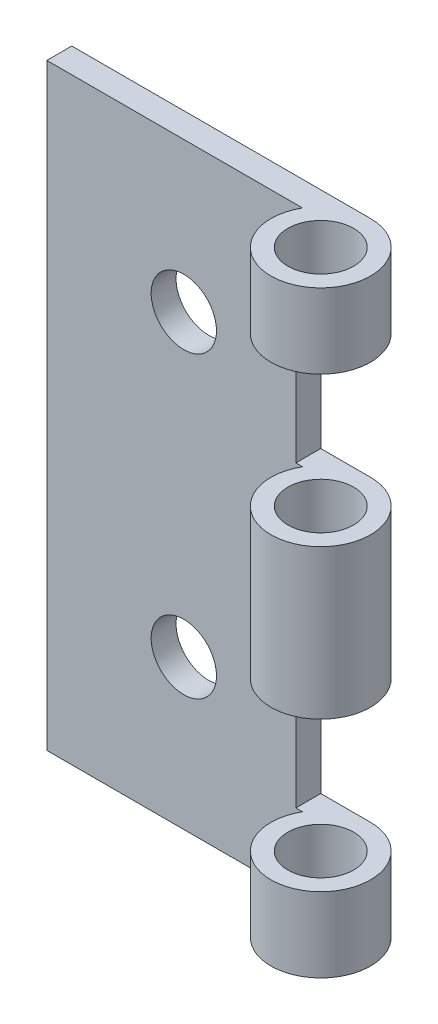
ISO-10303-21;
HEADER;
FILE_DESCRIPTION(('STEP AP214'),'2;1');
FILE_NAME('part.step','',(''),(''),'','','');
FILE_SCHEMA(('AUTOMOTIVE_DESIGN { 1 0 10303 214 1 1 1 1 }'));
ENDSEC;
DATA;
#1=APPLICATION_CONTEXT('core data for automotive mechanical design processes');
#2=APPLICATION_PROTOCOL_DEFINITION('international standard','automotive_design',2000,#1);
#3=PRODUCT_CONTEXT('',#1,'mechanical');
#4=PRODUCT('Part','Part','',(#3));
#5=PRODUCT_RELATED_PRODUCT_CATEGORY('part','',(#4));
#6=PRODUCT_DEFINITION_FORMATION('','',#4);
#7=PRODUCT_DEFINITION_CONTEXT('part definition',#1,'design');
#8=PRODUCT_DEFINITION('design','',#6,#7);
#9=PRODUCT_DEFINITION_SHAPE('','',#8);
#10=(LENGTH_UNIT() NAMED_UNIT(*) SI_UNIT(.MILLI.,.METRE.));
#11=(NAMED_UNIT(*) PLANE_ANGLE_UNIT() SI_UNIT($,.RADIAN.));
#12=(NAMED_UNIT(*) SI_UNIT($,.STERADIAN.) SOLID_ANGLE_UNIT());
#13=UNCERTAINTY_MEASURE_WITH_UNIT(LENGTH_MEASURE(1.E-05),#10,'distance_accuracy_value','');
#14=(GEOMETRIC_REPRESENTATION_CONTEXT(3) GLOBAL_UNCERTAINTY_ASSIGNED_CONTEXT((#13)) GLOBAL_UNIT_ASSIGNED_CONTEXT((#10,
#11,#12)) REPRESENTATION_CONTEXT('',''));
#15=CARTESIAN_POINT('',(0.,0.,0.));
#16=DIRECTION('',(0.,0.,1.));
#17=DIRECTION('',(1.,0.,0.));
#18=AXIS2_PLACEMENT_3D('',#15,#16,#17);
#19=CARTESIAN_POINT('',(0.,76.2,-3.175));
#20=DIRECTION('',(0.,0.,1.));
#21=DIRECTION('',(1.,0.,0.));
#22=AXIS2_PLACEMENT_3D('',#19,#20,#21);
#23=PLANE('',#22);
#24=CARTESIAN_POINT('',(-20.6375,19.05,-3.175));
#25=DIRECTION('',(0.,0.,1.));
#26=DIRECTION('',(1.,0.,0.));
#27=AXIS2_PLACEMENT_3D('',#24,#25,#26);
#28=CIRCLE('',#27,4.1656);
#29=CARTESIAN_POINT('',(-16.4719,19.05,-3.175));
#30=VERTEX_POINT('',#29);
#31=EDGE_CURVE('E196',#30,#30,#28,.T.);
#32=ORIENTED_EDGE('',*,*,#31,.T.);
#33=EDGE_LOOP('',(#32));
#34=FACE_BOUND('',#33,.T.);
#35=CARTESIAN_POINT('',(-20.6375,57.15,-3.175));
#36=DIRECTION('',(0.,0.,1.));
#37=DIRECTION('',(1.,0.,0.));
#38=AXIS2_PLACEMENT_3D('',#35,#36,#37);
#39=CIRCLE('',#38,4.1656);
#40=CARTESIAN_POINT('',(-16.4719,57.15,-3.175));
#41=VERTEX_POINT('',#40);
#42=EDGE_CURVE('E202',#41,#41,#39,.T.);
#43=ORIENTED_EDGE('',*,*,#42,.T.);
#44=EDGE_LOOP('',(#43));
#45=FACE_BOUND('',#44,.T.);
#46=DIRECTION('',(1.,0.,0.));
#47=VECTOR('',#46,1.);
#48=CARTESIAN_POINT('',(0.,28.575,-3.175));
#49=LINE('',#48,#47);
#50=CARTESIAN_POINT('',(-6.35000000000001,28.575,-3.175));
#51=VERTEX_POINT('',#50);
#52=CARTESIAN_POINT('',(0.,28.575,-3.175));
#53=VERTEX_POINT('',#52);
#54=EDGE_CURVE('E133',#51,#53,#49,.T.);
#55=ORIENTED_EDGE('',*,*,#54,.F.);
#56=DIRECTION('',(0.,1.,0.));
#57=VECTOR('',#56,1.);
#58=CARTESIAN_POINT('',(-6.35000000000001,76.2,-3.175));
#59=LINE('',#58,#57);
#60=CARTESIAN_POINT('',(-6.35000000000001,9.525,-3.175));
#61=VERTEX_POINT('',#60);
#62=EDGE_CURVE('E132',#61,#51,#59,.T.);
#63=ORIENTED_EDGE('',*,*,#62,.F.);
#64=DIRECTION('',(-1.,0.,0.));
#65=VECTOR('',#64,1.);
#66=CARTESIAN_POINT('',(0.,9.52499999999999,-3.175));
#67=LINE('',#66,#65);
#68=CARTESIAN_POINT('',(0.,9.52499999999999,-3.175));
#69=VERTEX_POINT('',#68);
#70=EDGE_CURVE('E139',#69,#61,#67,.T.);
#71=ORIENTED_EDGE('',*,*,#70,.F.);
#72=DIRECTION('',(0.,1.,0.));
#73=VECTOR('',#72,1.);
#74=CARTESIAN_POINT('',(0.,0.,-3.175));
#75=LINE('',#74,#73);
#76=CARTESIAN_POINT('',(0.,0.,-3.175));
#77=VERTEX_POINT('',#76);
#78=EDGE_CURVE('E213',#77,#69,#75,.T.);
#79=ORIENTED_EDGE('',*,*,#78,.F.);
#80=DIRECTION('',(1.,0.,0.));
#81=VECTOR('',#80,1.);
#82=CARTESIAN_POINT('',(0.,0.,-3.175));
#83=LINE('',#82,#81);
#84=CARTESIAN_POINT('',(-38.1,0.,-3.175));
#85=VERTEX_POINT('',#84);
#86=EDGE_CURVE('E223',#85,#77,#83,.T.);
#87=ORIENTED_EDGE('',*,*,#86,.F.);
#88=DIRECTION('',(0.,-1.,0.));
#89=VECTOR('',#88,1.);
#90=CARTESIAN_POINT('',(-38.1,0.,-3.175));
#91=LINE('',#90,#89);
#92=CARTESIAN_POINT('',(-38.1,76.2,-3.175));
#93=VERTEX_POINT('',#92);
#94=EDGE_CURVE('E220',#93,#85,#91,.T.);
#95=ORIENTED_EDGE('',*,*,#94,.F.);
#96=DIRECTION('',(-1.,0.,0.));
#97=VECTOR('',#96,1.);
#98=CARTESIAN_POINT('',(0.,76.2,-3.175));
#99=LINE('',#98,#97);
#100=CARTESIAN_POINT('',(0.,76.2,-3.175));
#101=VERTEX_POINT('',#100);
#102=EDGE_CURVE('E216',#101,#93,#99,.T.);
#103=ORIENTED_EDGE('',*,*,#102,.F.);
#104=CARTESIAN_POINT('',(0.,66.675,-3.175));
#105=VERTEX_POINT('',#104);
#106=EDGE_CURVE('E212',#105,#101,#75,.T.);
#107=ORIENTED_EDGE('',*,*,#106,.F.);
#108=DIRECTION('',(1.,0.,0.));
#109=VECTOR('',#108,1.);
#110=CARTESIAN_POINT('',(0.,66.675,-3.175));
#111=LINE('',#110,#109);
#112=CARTESIAN_POINT('',(-6.35000000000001,66.675,-3.175));
#113=VERTEX_POINT('',#112);
#114=EDGE_CURVE('E173',#113,#105,#111,.T.);
#115=ORIENTED_EDGE('',*,*,#114,.F.);
#116=DIRECTION('',(0.,1.,0.));
#117=VECTOR('',#116,1.);
#118=CARTESIAN_POINT('',(-6.35000000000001,76.2,-3.175));
#119=LINE('',#118,#117);
#120=CARTESIAN_POINT('',(-6.35000000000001,47.625,-3.175));
#121=VERTEX_POINT('',#120);
#122=EDGE_CURVE('E179',#121,#113,#119,.T.);
#123=ORIENTED_EDGE('',*,*,#122,.F.);
#124=DIRECTION('',(-1.,0.,0.));
#125=VECTOR('',#124,1.);
#126=CARTESIAN_POINT('',(0.,47.625,-3.175));
#127=LINE('',#126,#125);
#128=CARTESIAN_POINT('',(0.,47.625,-3.175));
#129=VERTEX_POINT('',#128);
#130=EDGE_CURVE('E167',#129,#121,#127,.T.);
#131=ORIENTED_EDGE('',*,*,#130,.F.);
#132=EDGE_CURVE('E217',#53,#129,#75,.T.);
#133=ORIENTED_EDGE('',*,*,#132,.F.);
#134=EDGE_LOOP('',(#55,#63,#71,#79,#87,#95,#103,#107,#115,#123,#131,#133));
#135=FACE_BOUND('',#134,.T.);
#136=ADVANCED_FACE('F30',(#34,#45,#135),#23,.F.);
#137=CARTESIAN_POINT('',(0.,76.2,0.));
#138=DIRECTION('',(0.,0.,1.));
#139=DIRECTION('',(1.,0.,0.));
#140=AXIS2_PLACEMENT_3D('',#137,#138,#139);
#141=PLANE('',#140);
#142=CARTESIAN_POINT('',(-20.6375,19.05,0.));
#143=DIRECTION('',(0.,0.,1.));
#144=DIRECTION('',(1.,0.,0.));
#145=AXIS2_PLACEMENT_3D('',#142,#143,#144);
#146=CIRCLE('',#145,4.1656);
#147=CARTESIAN_POINT('',(-16.4719,19.05,0.));
#148=VERTEX_POINT('',#147);
#149=EDGE_CURVE('E193',#148,#148,#146,.T.);
#150=ORIENTED_EDGE('',*,*,#149,.F.);
#151=EDGE_LOOP('',(#150));
#152=FACE_BOUND('',#151,.T.);
#153=CARTESIAN_POINT('',(-20.6375,57.15,0.));
#154=DIRECTION('',(0.,0.,1.));
#155=DIRECTION('',(1.,0.,0.));
#156=AXIS2_PLACEMENT_3D('',#153,#154,#155);
#157=CIRCLE('',#156,4.1656);
#158=CARTESIAN_POINT('',(-16.4719,57.15,0.));
#159=VERTEX_POINT('',#158);
#160=EDGE_CURVE('E199',#159,#159,#157,.T.);
#161=ORIENTED_EDGE('',*,*,#160,.F.);
#162=EDGE_LOOP('',(#161));
#163=FACE_BOUND('',#162,.T.);
#164=DIRECTION('',(0.,1.,0.));
#165=VECTOR('',#164,1.);
#166=CARTESIAN_POINT('',(-6.35000000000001,76.2,0.));
#167=LINE('',#166,#165);
#168=CARTESIAN_POINT('',(-6.35000000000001,9.525,0.));
#169=VERTEX_POINT('',#168);
#170=CARTESIAN_POINT('',(-6.35000000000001,28.575,0.));
#171=VERTEX_POINT('',#170);
#172=EDGE_CURVE('E123',#169,#171,#167,.T.);
#173=ORIENTED_EDGE('',*,*,#172,.T.);
#174=DIRECTION('',(1.,0.,0.));
#175=VECTOR('',#174,1.);
#176=CARTESIAN_POINT('',(0.,28.575,0.));
#177=LINE('',#176,#175);
#178=CARTESIAN_POINT('',(-5.49926131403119,28.575,0.));
#179=VERTEX_POINT('',#178);
#180=EDGE_CURVE('E150',#171,#179,#177,.T.);
#181=ORIENTED_EDGE('',*,*,#180,.T.);
#182=DIRECTION('',(0.,-1.,0.));
#183=VECTOR('',#182,1.);
#184=CARTESIAN_POINT('',(-5.49926131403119,76.2,0.));
#185=LINE('',#184,#183);
#186=CARTESIAN_POINT('',(-5.49926131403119,47.625,0.));
#187=VERTEX_POINT('',#186);
#188=EDGE_CURVE('E233',#187,#179,#185,.T.);
#189=ORIENTED_EDGE('',*,*,#188,.F.);
#190=DIRECTION('',(-1.,0.,0.));
#191=VECTOR('',#190,1.);
#192=CARTESIAN_POINT('',(0.,47.625,0.));
#193=LINE('',#192,#191);
#194=CARTESIAN_POINT('',(-6.35000000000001,47.625,0.));
#195=VERTEX_POINT('',#194);
#196=EDGE_CURVE('E164',#187,#195,#193,.T.);
#197=ORIENTED_EDGE('',*,*,#196,.T.);
#198=DIRECTION('',(0.,1.,0.));
#199=VECTOR('',#198,1.);
#200=CARTESIAN_POINT('',(-6.35000000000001,76.2,0.));
#201=LINE('',#200,#199);
#202=CARTESIAN_POINT('',(-6.35000000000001,66.675,0.));
#203=VERTEX_POINT('',#202);
#204=EDGE_CURVE('E176',#195,#203,#201,.T.);
#205=ORIENTED_EDGE('',*,*,#204,.T.);
#206=DIRECTION('',(1.,0.,0.));
#207=VECTOR('',#206,1.);
#208=CARTESIAN_POINT('',(0.,66.675,0.));
#209=LINE('',#208,#207);
#210=CARTESIAN_POINT('',(-5.49926131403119,66.675,0.));
#211=VERTEX_POINT('',#210);
#212=EDGE_CURVE('E171',#203,#211,#209,.T.);
#213=ORIENTED_EDGE('',*,*,#212,.T.);
#214=CARTESIAN_POINT('',(-5.49926131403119,76.2,0.));
#215=VERTEX_POINT('',#214);
#216=EDGE_CURVE('E53',#215,#211,#185,.T.);
#217=ORIENTED_EDGE('',*,*,#216,.F.);
#218=DIRECTION('',(-1.,0.,0.));
#219=VECTOR('',#218,1.);
#220=CARTESIAN_POINT('',(0.,76.2,0.));
#221=LINE('',#220,#219);
#222=CARTESIAN_POINT('',(-38.1,76.2,0.));
#223=VERTEX_POINT('',#222);
#224=EDGE_CURVE('E205',#215,#223,#221,.T.);
#225=ORIENTED_EDGE('',*,*,#224,.T.);
#226=DIRECTION('',(0.,-1.,0.));
#227=VECTOR('',#226,1.);
#228=CARTESIAN_POINT('',(-38.1,0.,0.));
#229=LINE('',#228,#227);
#230=CARTESIAN_POINT('',(-38.1,0.,0.));
#231=VERTEX_POINT('',#230);
#232=EDGE_CURVE('E207',#223,#231,#229,.T.);
#233=ORIENTED_EDGE('',*,*,#232,.T.);
#234=DIRECTION('',(1.,0.,0.));
#235=VECTOR('',#234,1.);
#236=CARTESIAN_POINT('',(0.,0.,0.));
#237=LINE('',#236,#235);
#238=CARTESIAN_POINT('',(-5.49926131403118,0.,0.));
#239=VERTEX_POINT('',#238);
#240=EDGE_CURVE('E210',#231,#239,#237,.T.);
#241=ORIENTED_EDGE('',*,*,#240,.T.);
#242=CARTESIAN_POINT('',(-5.49926131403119,9.52499999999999,0.));
#243=VERTEX_POINT('',#242);
#244=EDGE_CURVE('E45',#243,#239,#185,.T.);
#245=ORIENTED_EDGE('',*,*,#244,.F.);
#246=DIRECTION('',(-1.,0.,0.));
#247=VECTOR('',#246,1.);
#248=CARTESIAN_POINT('',(0.,9.52499999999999,0.));
#249=LINE('',#248,#247);
#250=EDGE_CURVE('E137',#243,#169,#249,.T.);
#251=ORIENTED_EDGE('',*,*,#250,.T.);
#252=EDGE_LOOP('',(#173,#181,#189,#197,#205,#213,#217,#225,#233,#241,#245,#251));
#253=FACE_BOUND('',#252,.T.);
#254=ADVANCED_FACE('F141',(#152,#163,#253),#141,.T.);
#255=CARTESIAN_POINT('',(0.,76.2,3.175));
#256=DIRECTION('',(0.,-1.,0.));
#257=DIRECTION('',(1.,0.,0.));
#258=AXIS2_PLACEMENT_3D('',#255,#256,#257);
#259=CYLINDRICAL_SURFACE('',#258,6.35);
#260=CARTESIAN_POINT('',(0.,28.575,3.175));
#261=DIRECTION('',(0.,-1.,0.));
#262=DIRECTION('',(1.,0.,0.));
#263=AXIS2_PLACEMENT_3D('',#260,#261,#262);
#264=CIRCLE('',#263,6.35);
#265=EDGE_CURVE('E144',#179,#53,#264,.F.);
#266=ORIENTED_EDGE('',*,*,#265,.T.);
#267=ORIENTED_EDGE('',*,*,#132,.T.);
#268=CARTESIAN_POINT('',(0.,47.625,3.175));
#269=DIRECTION('',(0.,1.,0.));
#270=DIRECTION('',(0.,0.,1.));
#271=AXIS2_PLACEMENT_3D('',#268,#269,#270);
#272=CIRCLE('',#271,6.35);
#273=EDGE_CURVE('E161',#129,#187,#272,.F.);
#274=ORIENTED_EDGE('',*,*,#273,.T.);
#275=ORIENTED_EDGE('',*,*,#188,.T.);
#276=EDGE_LOOP('',(#266,#267,#274,#275));
#277=FACE_BOUND('',#276,.T.);
#278=ADVANCED_FACE('F255',(#277),#259,.T.);
#279=ORIENTED_EDGE('',*,*,#78,.T.);
#280=CARTESIAN_POINT('',(0.,9.52499999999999,3.175));
#281=DIRECTION('',(0.,1.,0.));
#282=DIRECTION('',(-1.,0.,0.));
#283=AXIS2_PLACEMENT_3D('',#280,#281,#282);
#284=CIRCLE('',#283,6.35);
#285=EDGE_CURVE('E142',#69,#243,#284,.F.);
#286=ORIENTED_EDGE('',*,*,#285,.T.);
#287=ORIENTED_EDGE('',*,*,#244,.T.);
#288=CARTESIAN_POINT('',(0.,0.,3.175));
#289=DIRECTION('',(0.,-1.,0.));
#290=DIRECTION('',(1.,0.,0.));
#291=AXIS2_PLACEMENT_3D('',#288,#289,#290);
#292=CIRCLE('',#291,6.35);
#293=EDGE_CURVE('E187',#77,#239,#292,.T.);
#294=ORIENTED_EDGE('',*,*,#293,.F.);
#295=EDGE_LOOP('',(#279,#286,#287,#294));
#296=FACE_BOUND('',#295,.T.);
#297=ADVANCED_FACE('F256',(#296),#259,.T.);
#298=CARTESIAN_POINT('',(0.,76.2,3.175));
#299=DIRECTION('',(0.,-1.,0.));
#300=DIRECTION('',(1.,0.,0.));
#301=AXIS2_PLACEMENT_3D('',#298,#299,#300);
#302=CYLINDRICAL_SURFACE('',#301,4.191);
#303=CARTESIAN_POINT('',(0.,47.625,3.175));
#304=DIRECTION('',(0.,1.,0.));
#305=DIRECTION('',(0.,0.,1.));
#306=AXIS2_PLACEMENT_3D('',#303,#304,#305);
#307=CIRCLE('',#306,4.191);
#308=CARTESIAN_POINT('',(4.191,47.625,3.175));
#309=VERTEX_POINT('',#308);
#310=EDGE_CURVE('E232',#309,#309,#307,.F.);
#311=CARTESIAN_POINT('',(0.,28.575,3.175));
#312=DIRECTION('',(0.,-1.,0.));
#313=DIRECTION('',(1.,0.,0.));
#314=AXIS2_PLACEMENT_3D('',#311,#312,#313);
#315=CIRCLE('',#314,4.191);
#316=CARTESIAN_POINT('',(4.191,28.575,3.175));
#317=VERTEX_POINT('',#316);
#318=EDGE_CURVE('E11',#317,#317,#315,.F.);
#319=CARTESIAN_POINT('',(4.191,47.625,3.175));
#320=CARTESIAN_POINT('',(4.191,47.4265625,3.175));
#321=CARTESIAN_POINT('',(4.191,47.228125,3.175));
#322=CARTESIAN_POINT('',(4.191,46.83125,3.175));
#323=CARTESIAN_POINT('',(4.191,46.6328125,3.175));
#324=CARTESIAN_POINT('',(4.191,46.2359375,3.175));
#325=CARTESIAN_POINT('',(4.191,46.0375,3.175));
#326=CARTESIAN_POINT('',(4.191,45.640625,3.175));
#327=CARTESIAN_POINT('',(4.191,45.4421875,3.175));
#328=CARTESIAN_POINT('',(4.191,45.0453125,3.175));
#329=CARTESIAN_POINT('',(4.191,44.846875,3.175));
#330=CARTESIAN_POINT('',(4.191,44.45,3.175));
#331=CARTESIAN_POINT('',(4.191,44.2515625,3.175));
#332=CARTESIAN_POINT('',(4.191,43.8546875,3.175));
#333=CARTESIAN_POINT('',(4.191,43.65625,3.175));
#334=CARTESIAN_POINT('',(4.191,43.259375,3.175));
#335=CARTESIAN_POINT('',(4.191,43.0609375,3.175));
#336=CARTESIAN_POINT('',(4.191,42.6640625,3.175));
#337=CARTESIAN_POINT('',(4.191,42.465625,3.175));
#338=CARTESIAN_POINT('',(4.191,42.06875,3.175));
#339=CARTESIAN_POINT('',(4.191,41.8703125,3.175));
#340=CARTESIAN_POINT('',(4.191,41.4734375,3.175));
#341=CARTESIAN_POINT('',(4.191,41.275,3.175));
#342=CARTESIAN_POINT('',(4.191,40.878125,3.175));
#343=CARTESIAN_POINT('',(4.191,40.6796875,3.175));
#344=CARTESIAN_POINT('',(4.191,40.2828125,3.175));
#345=CARTESIAN_POINT('',(4.191,40.084375,3.175));
#346=CARTESIAN_POINT('',(4.191,39.6875,3.175));
#347=CARTESIAN_POINT('',(4.191,39.4890625,3.175));
#348=CARTESIAN_POINT('',(4.191,39.0921875,3.175));
#349=CARTESIAN_POINT('',(4.191,38.89375,3.175));
#350=CARTESIAN_POINT('',(4.191,38.496875,3.175));
#351=CARTESIAN_POINT('',(4.191,38.2984375,3.175));
#352=CARTESIAN_POINT('',(4.191,37.9015625,3.175));
#353=CARTESIAN_POINT('',(4.191,37.703125,3.175));
#354=CARTESIAN_POINT('',(4.191,37.30625,3.175));
#355=CARTESIAN_POINT('',(4.191,37.1078125,3.175));
#356=CARTESIAN_POINT('',(4.191,36.7109375,3.175));
#357=CARTESIAN_POINT('',(4.191,36.5125,3.175));
#358=CARTESIAN_POINT('',(4.191,36.115625,3.175));
#359=CARTESIAN_POINT('',(4.191,35.9171875,3.175));
#360=CARTESIAN_POINT('',(4.191,35.5203125,3.175));
#361=CARTESIAN_POINT('',(4.191,35.321875,3.175));
#362=CARTESIAN_POINT('',(4.191,34.925,3.175));
#363=CARTESIAN_POINT('',(4.191,34.7265625,3.175));
#364=CARTESIAN_POINT('',(4.191,34.3296875,3.175));
#365=CARTESIAN_POINT('',(4.191,34.13125,3.175));
#366=CARTESIAN_POINT('',(4.191,33.734375,3.175));
#367=CARTESIAN_POINT('',(4.191,33.5359375,3.175));
#368=CARTESIAN_POINT('',(4.191,33.1390625,3.175));
#369=CARTESIAN_POINT('',(4.191,32.940625,3.175));
#370=CARTESIAN_POINT('',(4.191,32.54375,3.175));
#371=CARTESIAN_POINT('',(4.191,32.3453125,3.175));
#372=CARTESIAN_POINT('',(4.191,31.9484375,3.175));
#373=CARTESIAN_POINT('',(4.191,31.75,3.175));
#374=CARTESIAN_POINT('',(4.191,31.353125,3.175));
#375=CARTESIAN_POINT('',(4.191,31.1546875,3.175));
#376=CARTESIAN_POINT('',(4.191,30.7578125,3.175));
#377=CARTESIAN_POINT('',(4.191,30.559375,3.175));
#378=CARTESIAN_POINT('',(4.191,30.1625,3.175));
#379=CARTESIAN_POINT('',(4.191,29.9640625,3.175));
#380=CARTESIAN_POINT('',(4.191,29.5671875,3.175));
#381=CARTESIAN_POINT('',(4.191,29.36875,3.175));
#382=CARTESIAN_POINT('',(4.191,28.971875,3.175));
#383=CARTESIAN_POINT('',(4.191,28.7734375,3.175));
#384=CARTESIAN_POINT('',(4.191,28.575,3.175));
#385=B_SPLINE_CURVE_WITH_KNOTS('',3,(#319,#320,#321,#322,#323,#324,#325,#326,#327,#328,#329,
#330,#331,#332,#333,#334,#335,#336,#337,#338,#339,#340,#341,#342,#343,#344,#345,#346,#347,#348,
#349,#350,#351,#352,#353,#354,#355,#356,#357,#358,#359,#360,#361,#362,#363,#364,#365,#366,#367,
#368,#369,#370,#371,#372,#373,#374,#375,#376,#377,#378,#379,#380,#381,#382,#383,#384),
.UNSPECIFIED.,.F.,.F.,(4,2,2,2,2,2,2,2,2,2,2,2,2,2,2,2,2,2,2,2,2,2,2,2,2,2,2,2,2,2,2,2,4),(0.,
0.5953125,1.190625,1.7859375,2.38125,2.9765625,3.571875,4.1671875,4.7625,5.3578125,5.953125,
6.5484375,7.14375,7.7390625,8.334375,8.9296875,9.525,10.1203125,10.715625,11.3109375,11.90625,
12.5015625,13.096875,13.6921875,14.2875,14.8828125,15.478125,16.0734375,16.66875,17.2640625,
17.859375,18.4546875,19.05),.UNSPECIFIED.);
#386=EDGE_CURVE('BSEAM245',#309,#317,#385,.T.);
#387=ORIENTED_EDGE('',*,*,#310,.F.);
#388=ORIENTED_EDGE('',*,*,#318,.F.);
#389=ORIENTED_EDGE('',*,*,#386,.T.);
#390=ORIENTED_EDGE('',*,*,#386,.F.);
#391=EDGE_LOOP('',(#387,#389,#388,#390));
#392=FACE_BOUND('',#391,.T.);
#393=ADVANCED_FACE('F245',(#392),#302,.F.);
#394=CARTESIAN_POINT('',(0.,0.,3.175));
#395=DIRECTION('',(0.,-1.,0.));
#396=DIRECTION('',(1.,0.,0.));
#397=AXIS2_PLACEMENT_3D('',#394,#395,#396);
#398=CIRCLE('',#397,4.191);
#399=CARTESIAN_POINT('',(4.191,0.,3.175));
#400=VERTEX_POINT('',#399);
#401=EDGE_CURVE('E181',#400,#400,#398,.T.);
#402=CARTESIAN_POINT('',(0.,9.52499999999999,3.175));
#403=DIRECTION('',(0.,1.,0.));
#404=DIRECTION('',(-1.,0.,0.));
#405=AXIS2_PLACEMENT_3D('',#402,#403,#404);
#406=CIRCLE('',#405,4.191);
#407=CARTESIAN_POINT('',(4.191,9.52500000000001,3.175));
#408=VERTEX_POINT('',#407);
#409=EDGE_CURVE('E38',#408,#408,#406,.F.);
#410=CARTESIAN_POINT('',(4.191,0.,3.175));
#411=CARTESIAN_POINT('',(4.191,0.0992187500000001,3.175));
#412=CARTESIAN_POINT('',(4.191,0.1984375,3.175));
#413=CARTESIAN_POINT('',(4.191,0.396875,3.175));
#414=CARTESIAN_POINT('',(4.191,0.49609375,3.175));
#415=CARTESIAN_POINT('',(4.191,0.69453125,3.175));
#416=CARTESIAN_POINT('',(4.191,0.79375,3.175));
#417=CARTESIAN_POINT('',(4.191,0.992187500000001,3.175));
#418=CARTESIAN_POINT('',(4.191,1.09140625,3.175));
#419=CARTESIAN_POINT('',(4.191,1.28984375,3.175));
#420=CARTESIAN_POINT('',(4.191,1.3890625,3.175));
#421=CARTESIAN_POINT('',(4.191,1.5875,3.175));
#422=CARTESIAN_POINT('',(4.191,1.68671875,3.175));
#423=CARTESIAN_POINT('',(4.191,1.88515625,3.175));
#424=CARTESIAN_POINT('',(4.191,1.984375,3.175));
#425=CARTESIAN_POINT('',(4.191,2.1828125,3.175));
#426=CARTESIAN_POINT('',(4.191,2.28203125,3.175));
#427=CARTESIAN_POINT('',(4.191,2.48046875,3.175));
#428=CARTESIAN_POINT('',(4.191,2.5796875,3.175));
#429=CARTESIAN_POINT('',(4.191,2.778125,3.175));
#430=CARTESIAN_POINT('',(4.191,2.87734375,3.175));
#431=CARTESIAN_POINT('',(4.191,3.07578125,3.175));
#432=CARTESIAN_POINT('',(4.191,3.175,3.175));
#433=CARTESIAN_POINT('',(4.191,3.3734375,3.175));
#434=CARTESIAN_POINT('',(4.191,3.47265625,3.175));
#435=CARTESIAN_POINT('',(4.191,3.67109375,3.175));
#436=CARTESIAN_POINT('',(4.191,3.7703125,3.175));
#437=CARTESIAN_POINT('',(4.191,3.96875,3.175));
#438=CARTESIAN_POINT('',(4.191,4.06796875,3.175));
#439=CARTESIAN_POINT('',(4.191,4.26640625,3.175));
#440=CARTESIAN_POINT('',(4.191,4.365625,3.175));
#441=CARTESIAN_POINT('',(4.191,4.5640625,3.175));
#442=CARTESIAN_POINT('',(4.191,4.66328125,3.175));
#443=CARTESIAN_POINT('',(4.191,4.86171875,3.175));
#444=CARTESIAN_POINT('',(4.191,4.9609375,3.175));
#445=CARTESIAN_POINT('',(4.191,5.159375,3.175));
#446=CARTESIAN_POINT('',(4.191,5.25859375,3.175));
#447=CARTESIAN_POINT('',(4.191,5.45703125,3.175));
#448=CARTESIAN_POINT('',(4.191,5.55625,3.175));
#449=CARTESIAN_POINT('',(4.191,5.7546875,3.175));
#450=CARTESIAN_POINT('',(4.191,5.85390625,3.175));
#451=CARTESIAN_POINT('',(4.191,6.05234375,3.175));
#452=CARTESIAN_POINT('',(4.191,6.1515625,3.175));
#453=CARTESIAN_POINT('',(4.191,6.35,3.175));
#454=CARTESIAN_POINT('',(4.191,6.44921875,3.175));
#455=CARTESIAN_POINT('',(4.191,6.64765625,3.175));
#456=CARTESIAN_POINT('',(4.191,6.746875,3.175));
#457=CARTESIAN_POINT('',(4.191,6.9453125,3.175));
#458=CARTESIAN_POINT('',(4.191,7.04453125,3.175));
#459=CARTESIAN_POINT('',(4.191,7.24296875,3.175));
#460=CARTESIAN_POINT('',(4.191,7.3421875,3.175));
#461=CARTESIAN_POINT('',(4.191,7.540625,3.175));
#462=CARTESIAN_POINT('',(4.191,7.63984375,3.175));
#463=CARTESIAN_POINT('',(4.191,7.83828125,3.175));
#464=CARTESIAN_POINT('',(4.191,7.93750000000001,3.175));
#465=CARTESIAN_POINT('',(4.191,8.1359375,3.175));
#466=CARTESIAN_POINT('',(4.191,8.23515625,3.175));
#467=CARTESIAN_POINT('',(4.191,8.43359375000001,3.175));
#468=CARTESIAN_POINT('',(4.191,8.53281250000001,3.175));
#469=CARTESIAN_POINT('',(4.191,8.73125,3.175));
#470=CARTESIAN_POINT('',(4.191,8.83046875,3.175));
#471=CARTESIAN_POINT('',(4.191,9.02890625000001,3.175));
#472=CARTESIAN_POINT('',(4.191,9.12812500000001,3.175));
#473=CARTESIAN_POINT('',(4.191,9.3265625,3.175));
#474=CARTESIAN_POINT('',(4.191,9.42578125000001,3.175));
#475=CARTESIAN_POINT('',(4.191,9.52500000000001,3.175));
#476=B_SPLINE_CURVE_WITH_KNOTS('',3,(#410,#411,#412,#413,#414,#415,#416,#417,#418,#419,#420,
#421,#422,#423,#424,#425,#426,#427,#428,#429,#430,#431,#432,#433,#434,#435,#436,#437,#438,#439,
#440,#441,#442,#443,#444,#445,#446,#447,#448,#449,#450,#451,#452,#453,#454,#455,#456,#457,#458,
#459,#460,#461,#462,#463,#464,#465,#466,#467,#468,#469,#470,#471,#472,#473,#474,#475),
.UNSPECIFIED.,.F.,.F.,(4,2,2,2,2,2,2,2,2,2,2,2,2,2,2,2,2,2,2,2,2,2,2,2,2,2,2,2,2,2,2,2,4),(0.,
0.29765625,0.5953125,0.892968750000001,1.190625,1.48828125,1.7859375,2.08359375,2.38125,
2.67890625,2.9765625,3.27421875,3.571875,3.86953125,4.1671875,4.46484375,4.7625,5.06015625,
5.3578125,5.65546875,5.953125,6.25078125,6.5484375,6.84609375,7.14375,7.44140625,7.7390625,
8.03671875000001,8.334375,8.63203125,8.92968750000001,9.22734375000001,9.52500000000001),.UNSPECIFIED.);
#477=EDGE_CURVE('BSEAM242',#400,#408,#476,.T.);
#478=ORIENTED_EDGE('',*,*,#401,.T.);
#479=ORIENTED_EDGE('',*,*,#409,.F.);
#480=ORIENTED_EDGE('',*,*,#477,.T.);
#481=ORIENTED_EDGE('',*,*,#477,.F.);
#482=EDGE_LOOP('',(#478,#480,#479,#481));
#483=FACE_BOUND('',#482,.T.);
#484=ADVANCED_FACE('F242',(#483),#302,.F.);
#485=CARTESIAN_POINT('',(0.,66.675,3.175));
#486=DIRECTION('',(0.,-1.,0.));
#487=DIRECTION('',(0.,0.,-1.));
#488=AXIS2_PLACEMENT_3D('',#485,#486,#487);
#489=CIRCLE('',#488,6.35);
#490=EDGE_CURVE('E169',#211,#105,#489,.F.);
#491=ORIENTED_EDGE('',*,*,#490,.T.);
#492=ORIENTED_EDGE('',*,*,#106,.T.);
#493=CARTESIAN_POINT('',(0.,76.2,3.175));
#494=DIRECTION('',(0.,-1.,0.));
#495=DIRECTION('',(1.,0.,0.));
#496=AXIS2_PLACEMENT_3D('',#493,#494,#495);
#497=CIRCLE('',#496,6.35);
#498=EDGE_CURVE('E190',#101,#215,#497,.T.);
#499=ORIENTED_EDGE('',*,*,#498,.T.);
#500=ORIENTED_EDGE('',*,*,#216,.T.);
#501=EDGE_LOOP('',(#491,#492,#499,#500));
#502=FACE_BOUND('',#501,.T.);
#503=ADVANCED_FACE('F244',(#502),#259,.T.);
#504=CARTESIAN_POINT('',(0.,76.2,3.175));
#505=DIRECTION('',(0.,-1.,0.));
#506=DIRECTION('',(1.,0.,0.));
#507=AXIS2_PLACEMENT_3D('',#504,#505,#506);
#508=CIRCLE('',#507,4.191);
#509=CARTESIAN_POINT('',(4.19099999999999,76.2,3.175));
#510=VERTEX_POINT('',#509);
#511=EDGE_CURVE('E184',#510,#510,#508,.T.);
#512=CARTESIAN_POINT('',(0.,66.675,3.175));
#513=DIRECTION('',(0.,-1.,0.));
#514=DIRECTION('',(0.,0.,-1.));
#515=AXIS2_PLACEMENT_3D('',#512,#513,#514);
#516=CIRCLE('',#515,4.191);
#517=CARTESIAN_POINT('',(4.19099999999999,66.675,3.175));
#518=VERTEX_POINT('',#517);
#519=EDGE_CURVE('E236',#518,#518,#516,.F.);
#520=CARTESIAN_POINT('',(4.19099999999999,76.2,3.175));
#521=CARTESIAN_POINT('',(4.19099999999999,76.10078125,3.175));
#522=CARTESIAN_POINT('',(4.19099999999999,76.0015625,3.175));
#523=CARTESIAN_POINT('',(4.19099999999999,75.803125,3.175));
#524=CARTESIAN_POINT('',(4.19099999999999,75.70390625,3.175));
#525=CARTESIAN_POINT('',(4.19099999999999,75.50546875,3.175));
#526=CARTESIAN_POINT('',(4.19099999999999,75.40625,3.175));
#527=CARTESIAN_POINT('',(4.19099999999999,75.2078125,3.175));
#528=CARTESIAN_POINT('',(4.19099999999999,75.10859375,3.175));
#529=CARTESIAN_POINT('',(4.19099999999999,74.91015625,3.175));
#530=CARTESIAN_POINT('',(4.19099999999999,74.8109375,3.175));
#531=CARTESIAN_POINT('',(4.19099999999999,74.6125,3.175));
#532=CARTESIAN_POINT('',(4.19099999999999,74.51328125,3.175));
#533=CARTESIAN_POINT('',(4.19099999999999,74.31484375,3.175));
#534=CARTESIAN_POINT('',(4.19099999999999,74.215625,3.175));
#535=CARTESIAN_POINT('',(4.19099999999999,74.0171875,3.175));
#536=CARTESIAN_POINT('',(4.19099999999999,73.91796875,3.175));
#537=CARTESIAN_POINT('',(4.19099999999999,73.71953125,3.175));
#538=CARTESIAN_POINT('',(4.19099999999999,73.6203125,3.175));
#539=CARTESIAN_POINT('',(4.19099999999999,73.421875,3.175));
#540=CARTESIAN_POINT('',(4.19099999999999,73.32265625,3.175));
#541=CARTESIAN_POINT('',(4.19099999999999,73.12421875,3.175));
#542=CARTESIAN_POINT('',(4.19099999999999,73.025,3.175));
#543=CARTESIAN_POINT('',(4.19099999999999,72.8265625,3.175));
#544=CARTESIAN_POINT('',(4.19099999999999,72.72734375,3.175));
#545=CARTESIAN_POINT('',(4.19099999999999,72.52890625,3.175));
#546=CARTESIAN_POINT('',(4.19099999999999,72.4296875,3.175));
#547=CARTESIAN_POINT('',(4.19099999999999,72.23125,3.175));
#548=CARTESIAN_POINT('',(4.19099999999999,72.13203125,3.175));
#549=CARTESIAN_POINT('',(4.19099999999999,71.93359375,3.175));
#550=CARTESIAN_POINT('',(4.19099999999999,71.834375,3.175));
#551=CARTESIAN_POINT('',(4.19099999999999,71.6359375,3.175));
#552=CARTESIAN_POINT('',(4.19099999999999,71.53671875,3.175));
#553=CARTESIAN_POINT('',(4.19099999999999,71.33828125,3.175));
#554=CARTESIAN_POINT('',(4.19099999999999,71.2390625,3.175));
#555=CARTESIAN_POINT('',(4.19099999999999,71.040625,3.175));
#556=CARTESIAN_POINT('',(4.19099999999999,70.94140625,3.175));
#557=CARTESIAN_POINT('',(4.19099999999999,70.74296875,3.175));
#558=CARTESIAN_POINT('',(4.19099999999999,70.64375,3.175));
#559=CARTESIAN_POINT('',(4.19099999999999,70.4453125,3.175));
#560=CARTESIAN_POINT('',(4.19099999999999,70.34609375,3.175));
#561=CARTESIAN_POINT('',(4.19099999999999,70.14765625,3.175));
#562=CARTESIAN_POINT('',(4.19099999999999,70.0484375,3.175));
#563=CARTESIAN_POINT('',(4.19099999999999,69.85,3.175));
#564=CARTESIAN_POINT('',(4.19099999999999,69.75078125,3.175));
#565=CARTESIAN_POINT('',(4.19099999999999,69.55234375,3.175));
#566=CARTESIAN_POINT('',(4.19099999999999,69.453125,3.175));
#567=CARTESIAN_POINT('',(4.19099999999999,69.2546875,3.175));
#568=CARTESIAN_POINT('',(4.19099999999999,69.15546875,3.175));
#569=CARTESIAN_POINT('',(4.19099999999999,68.95703125,3.175));
#570=CARTESIAN_POINT('',(4.19099999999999,68.8578125,3.175));
#571=CARTESIAN_POINT('',(4.19099999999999,68.659375,3.175));
#572=CARTESIAN_POINT('',(4.19099999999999,68.56015625,3.175));
#573=CARTESIAN_POINT('',(4.19099999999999,68.36171875,3.175));
#574=CARTESIAN_POINT('',(4.19099999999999,68.2625,3.175));
#575=CARTESIAN_POINT('',(4.19099999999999,68.0640625,3.175));
#576=CARTESIAN_POINT('',(4.19099999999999,67.96484375,3.175));
#577=CARTESIAN_POINT('',(4.19099999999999,67.76640625,3.175));
#578=CARTESIAN_POINT('',(4.19099999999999,67.6671875,3.175));
#579=CARTESIAN_POINT('',(4.19099999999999,67.46875,3.175));
#580=CARTESIAN_POINT('',(4.19099999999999,67.36953125,3.175));
#581=CARTESIAN_POINT('',(4.19099999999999,67.17109375,3.175));
#582=CARTESIAN_POINT('',(4.19099999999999,67.071875,3.175));
#583=CARTESIAN_POINT('',(4.19099999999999,66.8734375,3.175));
#584=CARTESIAN_POINT('',(4.19099999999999,66.77421875,3.175));
#585=CARTESIAN_POINT('',(4.19099999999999,66.675,3.175));
#586=B_SPLINE_CURVE_WITH_KNOTS('',3,(#520,#521,#522,#523,#524,#525,#526,#527,#528,#529,#530,
#531,#532,#533,#534,#535,#536,#537,#538,#539,#540,#541,#542,#543,#544,#545,#546,#547,#548,#549,
#550,#551,#552,#553,#554,#555,#556,#557,#558,#559,#560,#561,#562,#563,#564,#565,#566,#567,#568,
#569,#570,#571,#572,#573,#574,#575,#576,#577,#578,#579,#580,#581,#582,#583,#584,#585),
.UNSPECIFIED.,.F.,.F.,(4,2,2,2,2,2,2,2,2,2,2,2,2,2,2,2,2,2,2,2,2,2,2,2,2,2,2,2,2,2,2,2,4),(0.,
0.29765625,0.5953125,0.892968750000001,1.190625,1.48828125,1.7859375,2.08359375,2.38125,
2.67890625,2.9765625,3.27421875,3.571875,3.86953125,4.1671875,4.46484375,4.7625,5.06015625,
5.3578125,5.65546875,5.953125,6.25078125,6.5484375,6.84609375,7.14375,7.44140625,7.7390625,
8.03671875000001,8.334375,8.63203125,8.92968750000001,9.22734375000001,9.52500000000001),.UNSPECIFIED.);
#587=EDGE_CURVE('BSEAM248',#510,#518,#586,.T.);
#588=ORIENTED_EDGE('',*,*,#511,.F.);
#589=ORIENTED_EDGE('',*,*,#519,.F.);
#590=ORIENTED_EDGE('',*,*,#587,.T.);
#591=ORIENTED_EDGE('',*,*,#587,.F.);
#592=EDGE_LOOP('',(#588,#590,#589,#591));
#593=FACE_BOUND('',#592,.T.);
#594=ADVANCED_FACE('F248',(#593),#302,.F.);
#595=CARTESIAN_POINT('',(0.,0.,-3.175));
#596=DIRECTION('',(0.,-1.,0.));
#597=DIRECTION('',(1.,0.,0.));
#598=AXIS2_PLACEMENT_3D('',#595,#596,#597);
#599=PLANE('',#598);
#600=ORIENTED_EDGE('',*,*,#401,.F.);
#601=EDGE_LOOP('',(#600));
#602=FACE_BOUND('',#601,.T.);
#603=ORIENTED_EDGE('',*,*,#86,.T.);
#604=ORIENTED_EDGE('',*,*,#293,.T.);
#605=ORIENTED_EDGE('',*,*,#240,.F.);
#606=DIRECTION('',(0.,0.,1.));
#607=VECTOR('',#606,1.);
#608=CARTESIAN_POINT('',(-38.1,0.,-3.175));
#609=LINE('',#608,#607);
#610=EDGE_CURVE('E227',#85,#231,#609,.T.);
#611=ORIENTED_EDGE('',*,*,#610,.F.);
#612=EDGE_LOOP('',(#603,#604,#605,#611));
#613=FACE_BOUND('',#612,.T.);
#614=ADVANCED_FACE('F260',(#602,#613),#599,.T.);
#615=CARTESIAN_POINT('',(-38.1,0.,-3.175));
#616=DIRECTION('',(-1.,0.,0.));
#617=DIRECTION('',(0.,0.,1.));
#618=AXIS2_PLACEMENT_3D('',#615,#616,#617);
#619=PLANE('',#618);
#620=ORIENTED_EDGE('',*,*,#232,.F.);
#621=DIRECTION('',(0.,0.,1.));
#622=VECTOR('',#621,1.);
#623=CARTESIAN_POINT('',(-38.1,76.2,-3.175));
#624=LINE('',#623,#622);
#625=EDGE_CURVE('E226',#93,#223,#624,.T.);
#626=ORIENTED_EDGE('',*,*,#625,.F.);
#627=ORIENTED_EDGE('',*,*,#94,.T.);
#628=ORIENTED_EDGE('',*,*,#610,.T.);
#629=EDGE_LOOP('',(#620,#626,#627,#628));
#630=FACE_BOUND('',#629,.T.);
#631=ADVANCED_FACE('F274',(#630),#619,.T.);
#632=CARTESIAN_POINT('',(0.,76.2,-3.175));
#633=DIRECTION('',(0.,1.,0.));
#634=DIRECTION('',(0.,0.,1.));
#635=AXIS2_PLACEMENT_3D('',#632,#633,#634);
#636=PLANE('',#635);
#637=ORIENTED_EDGE('',*,*,#511,.T.);
#638=EDGE_LOOP('',(#637));
#639=FACE_BOUND('',#638,.T.);
#640=ORIENTED_EDGE('',*,*,#224,.F.);
#641=ORIENTED_EDGE('',*,*,#498,.F.);
#642=ORIENTED_EDGE('',*,*,#102,.T.);
#643=ORIENTED_EDGE('',*,*,#625,.T.);
#644=EDGE_LOOP('',(#640,#641,#642,#643));
#645=FACE_BOUND('',#644,.T.);
#646=ADVANCED_FACE('F32',(#639,#645),#636,.T.);
#647=CARTESIAN_POINT('',(-20.6375,57.15,-3.175));
#648=DIRECTION('',(0.,0.,1.));
#649=DIRECTION('',(1.,0.,0.));
#650=AXIS2_PLACEMENT_3D('',#647,#648,#649);
#651=CYLINDRICAL_SURFACE('',#650,4.1656);
#652=ORIENTED_EDGE('',*,*,#42,.F.);
#653=EDGE_LOOP('',(#652));
#654=FACE_BOUND('',#653,.T.);
#655=ORIENTED_EDGE('',*,*,#160,.T.);
#656=EDGE_LOOP('',(#655));
#657=FACE_BOUND('',#656,.T.);
#658=ADVANCED_FACE('F281',(#654,#657),#651,.F.);
#659=CARTESIAN_POINT('',(-20.6375,19.05,-3.175));
#660=DIRECTION('',(0.,0.,1.));
#661=DIRECTION('',(1.,0.,0.));
#662=AXIS2_PLACEMENT_3D('',#659,#660,#661);
#663=CYLINDRICAL_SURFACE('',#662,4.1656);
#664=ORIENTED_EDGE('',*,*,#31,.F.);
#665=EDGE_LOOP('',(#664));
#666=FACE_BOUND('',#665,.T.);
#667=ORIENTED_EDGE('',*,*,#149,.T.);
#668=EDGE_LOOP('',(#667));
#669=FACE_BOUND('',#668,.T.);
#670=ADVANCED_FACE('F320',(#666,#669),#663,.F.);
#671=CARTESIAN_POINT('',(-6.35000000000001,66.675,115.376871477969));
#672=DIRECTION('',(1.,0.,0.));
#673=DIRECTION('',(0.,1.,0.));
#674=AXIS2_PLACEMENT_3D('',#671,#672,#673);
#675=PLANE('',#674);
#676=DIRECTION('',(0.,0.,-1.));
#677=VECTOR('',#676,1.);
#678=CARTESIAN_POINT('',(-6.35000000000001,47.625,115.376871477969));
#679=LINE('',#678,#677);
#680=EDGE_CURVE('E155',#195,#121,#679,.T.);
#681=ORIENTED_EDGE('',*,*,#680,.T.);
#682=ORIENTED_EDGE('',*,*,#122,.T.);
#683=DIRECTION('',(0.,0.,-1.));
#684=VECTOR('',#683,1.);
#685=CARTESIAN_POINT('',(-6.35000000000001,66.675,115.376871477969));
#686=LINE('',#685,#684);
#687=EDGE_CURVE('E158',#203,#113,#686,.T.);
#688=ORIENTED_EDGE('',*,*,#687,.F.);
#689=ORIENTED_EDGE('',*,*,#204,.F.);
#690=EDGE_LOOP('',(#681,#682,#688,#689));
#691=FACE_BOUND('',#690,.T.);
#692=ADVANCED_FACE('F306',(#691),#675,.T.);
#693=CARTESIAN_POINT('',(8.07195680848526,66.675,115.376871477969));
#694=DIRECTION('',(0.,-1.,0.));
#695=DIRECTION('',(0.,0.,-1.));
#696=AXIS2_PLACEMENT_3D('',#693,#694,#695);
#697=PLANE('',#696);
#698=ORIENTED_EDGE('',*,*,#519,.T.);
#699=EDGE_LOOP('',(#698));
#700=FACE_BOUND('',#699,.T.);
#701=ORIENTED_EDGE('',*,*,#687,.T.);
#702=ORIENTED_EDGE('',*,*,#114,.T.);
#703=ORIENTED_EDGE('',*,*,#490,.F.);
#704=ORIENTED_EDGE('',*,*,#212,.F.);
#705=EDGE_LOOP('',(#701,#702,#703,#704));
#706=FACE_BOUND('',#705,.T.);
#707=ADVANCED_FACE('F308',(#700,#706),#697,.T.);
#708=CARTESIAN_POINT('',(-6.35000000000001,47.625,115.376871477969));
#709=DIRECTION('',(0.,1.,0.));
#710=DIRECTION('',(0.,0.,1.));
#711=AXIS2_PLACEMENT_3D('',#708,#709,#710);
#712=PLANE('',#711);
#713=ORIENTED_EDGE('',*,*,#310,.T.);
#714=EDGE_LOOP('',(#713));
#715=FACE_BOUND('',#714,.T.);
#716=ORIENTED_EDGE('',*,*,#273,.F.);
#717=ORIENTED_EDGE('',*,*,#130,.T.);
#718=ORIENTED_EDGE('',*,*,#680,.F.);
#719=ORIENTED_EDGE('',*,*,#196,.F.);
#720=EDGE_LOOP('',(#716,#717,#718,#719));
#721=FACE_BOUND('',#720,.T.);
#722=ADVANCED_FACE('F299',(#715,#721),#712,.T.);
#723=CARTESIAN_POINT('',(-6.35000000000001,28.575,115.376871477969));
#724=DIRECTION('',(1.,0.,0.));
#725=DIRECTION('',(0.,0.,-1.));
#726=AXIS2_PLACEMENT_3D('',#723,#724,#725);
#727=PLANE('',#726);
#728=DIRECTION('',(0.,0.,-1.));
#729=VECTOR('',#728,1.);
#730=CARTESIAN_POINT('',(-6.35000000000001,9.525,115.376871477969));
#731=LINE('',#730,#729);
#732=EDGE_CURVE('E126',#169,#61,#731,.T.);
#733=ORIENTED_EDGE('',*,*,#732,.T.);
#734=ORIENTED_EDGE('',*,*,#62,.T.);
#735=DIRECTION('',(0.,0.,-1.));
#736=VECTOR('',#735,1.);
#737=CARTESIAN_POINT('',(-6.35000000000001,28.575,115.376871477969));
#738=LINE('',#737,#736);
#739=EDGE_CURVE('E129',#171,#51,#738,.T.);
#740=ORIENTED_EDGE('',*,*,#739,.F.);
#741=ORIENTED_EDGE('',*,*,#172,.F.);
#742=EDGE_LOOP('',(#733,#734,#740,#741));
#743=FACE_BOUND('',#742,.T.);
#744=ADVANCED_FACE('F125',(#743),#727,.T.);
#745=CARTESIAN_POINT('',(10.952200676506,28.575,115.376871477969));
#746=DIRECTION('',(0.,-1.,0.));
#747=DIRECTION('',(1.,0.,0.));
#748=AXIS2_PLACEMENT_3D('',#745,#746,#747);
#749=PLANE('',#748);
#750=ORIENTED_EDGE('',*,*,#318,.T.);
#751=EDGE_LOOP('',(#750));
#752=FACE_BOUND('',#751,.T.);
#753=ORIENTED_EDGE('',*,*,#739,.T.);
#754=ORIENTED_EDGE('',*,*,#54,.T.);
#755=ORIENTED_EDGE('',*,*,#265,.F.);
#756=ORIENTED_EDGE('',*,*,#180,.F.);
#757=EDGE_LOOP('',(#753,#754,#755,#756));
#758=FACE_BOUND('',#757,.T.);
#759=ADVANCED_FACE('F292',(#752,#758),#749,.T.);
#760=CARTESIAN_POINT('',(-6.35000000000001,9.525,115.376871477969));
#761=DIRECTION('',(0.,1.,0.));
#762=DIRECTION('',(-1.,0.,0.));
#763=AXIS2_PLACEMENT_3D('',#760,#761,#762);
#764=PLANE('',#763);
#765=ORIENTED_EDGE('',*,*,#409,.T.);
#766=EDGE_LOOP('',(#765));
#767=FACE_BOUND('',#766,.T.);
#768=ORIENTED_EDGE('',*,*,#285,.F.);
#769=ORIENTED_EDGE('',*,*,#70,.T.);
#770=ORIENTED_EDGE('',*,*,#732,.F.);
#771=ORIENTED_EDGE('',*,*,#250,.F.);
#772=EDGE_LOOP('',(#768,#769,#770,#771));
#773=FACE_BOUND('',#772,.T.);
#774=ADVANCED_FACE('F136',(#767,#773),#764,.T.);
#775=CLOSED_SHELL('',(#136,#254,#278,#297,#393,#484,#503,#594,#614,#631,#646,#658,#670,#692,
#707,#722,#744,#759,#774));
#776=MANIFOLD_SOLID_BREP('B2',#775);
#777=ADVANCED_BREP_SHAPE_REPRESENTATION('',(#18,#776),#14);
#778=SHAPE_DEFINITION_REPRESENTATION(#9,#777);
ENDSEC;
END-ISO-10303-21;
